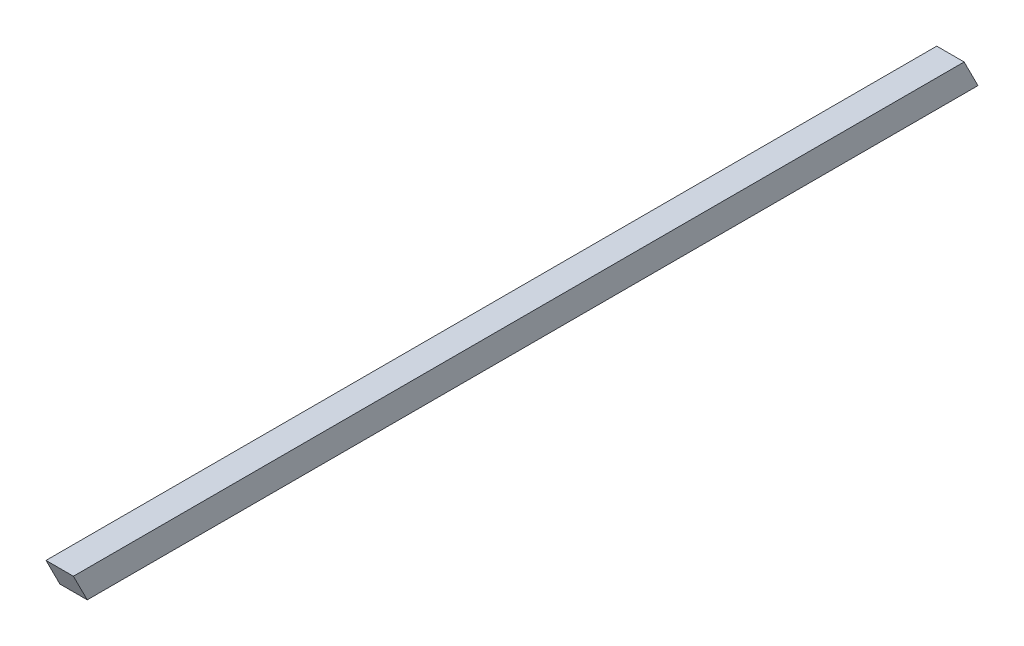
from build123d import *

# Parameters (mm, degrees)
ESQUISSE1_W             = 4
ESQUISSE1_H             = 4
EXTRUSION1_DEPTH        = 65
ENL_V_MAT_EXTRU_1_DEPTH = 300
EXTRUSION2_DEPTH        = 4


with BuildPart() as part:
    # Esquisse1 → Extrusion1 (new, symmetric)
    with BuildSketch(Plane.XY):
        Rectangle(ESQUISSE1_W, ESQUISSE1_H)
    extrude(amount=EXTRUSION1_DEPTH, both=True)

    # Esquisse2 → Enl_v. mat.-Extru.1 (cut)
    with BuildSketch(Plane.ZY.offset(2)):
        Polygon((-65, -2), (-62.977701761, 2), (-65, 2), align=None)
    extrude(amount=-ENL_V_MAT_EXTRU_1_DEPTH, mode=Mode.SUBTRACT)

    # Esquisse3 → Extrusion2 (add)
    with BuildSketch(Plane.ZY.offset(2)):
        Polygon((65, 2), (65, -2), (67.022298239, 2), align=None)
    extrude(amount=-EXTRUSION2_DEPTH)


solid = part.part
